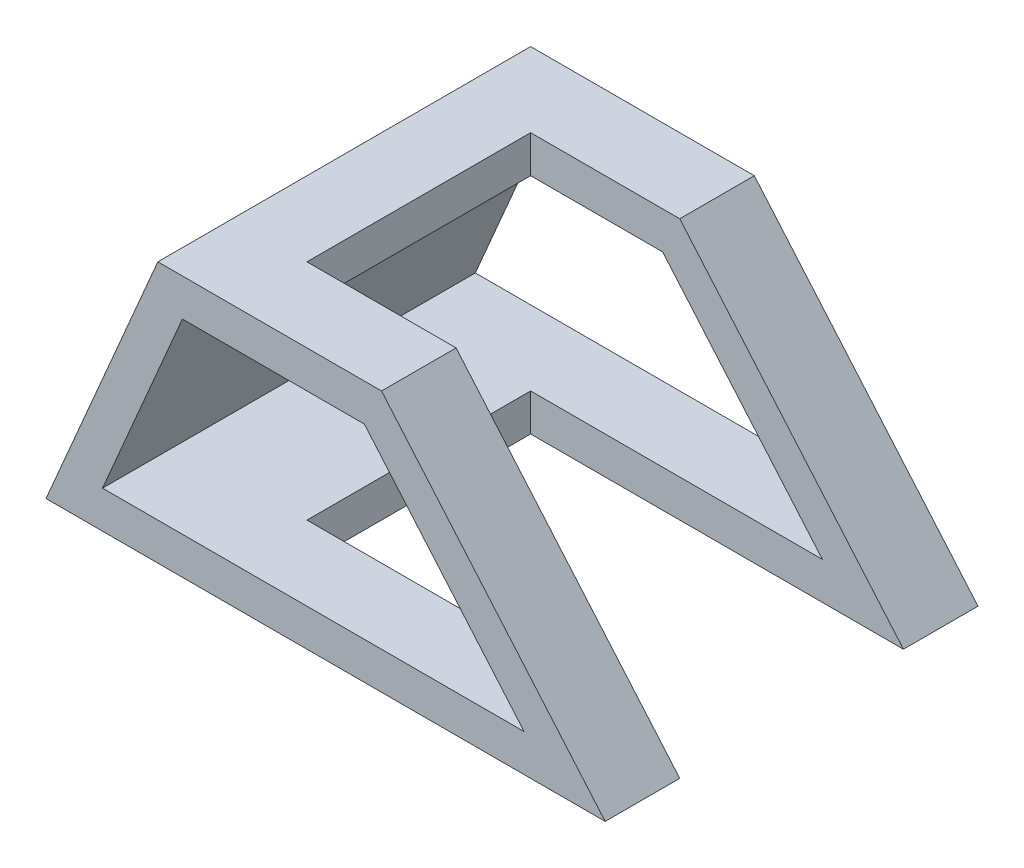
from build123d import *

# Parameters (mm, degrees)
BOSS_EXTRU_1_DEPTH      = 50
ESQUISSE2_W             = 200
ESQUISSE2_H             = 60
ENL_V_MAT_EXTRU_1_DEPTH = 118.150222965


with BuildPart() as part:
    # Esquisse1 → Boss.-Extru.1 (new, symmetric)
    with BuildSketch(Plane.XY):
        Polygon((70.475319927, 0), (-79.524680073, 0), (-49.524680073, 70), (10.475319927, 70), align=None)
        Polygon((-64.359289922, 10), (-42.930718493, 60), (5.875970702, 60), (48.733113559, 10), align=None, mode=Mode.SUBTRACT)
    extrude(amount=BOSS_EXTRU_1_DEPTH, both=True)

    # Esquisse2 → Enl_v. mat.-Extru.1 (cut, through all)
    with BuildSketch(Plane(origin=(0, 70, 0), x_dir=(1, 0, 0), z_dir=(0, 1, 0))):
        with Locations((70.475319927, 0)):
            Rectangle(ESQUISSE2_W, ESQUISSE2_H)
    extrude(amount=-ENL_V_MAT_EXTRU_1_DEPTH, mode=Mode.SUBTRACT)


solid = part.part
